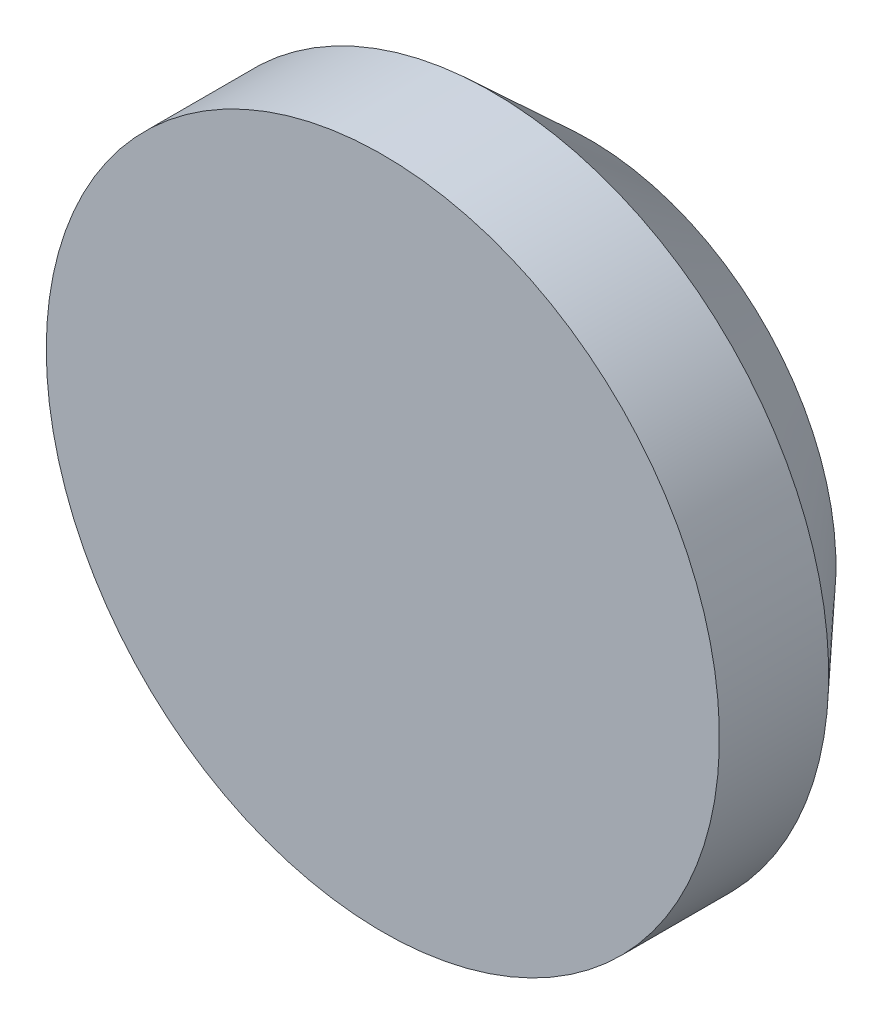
ISO-10303-21;
HEADER;
FILE_DESCRIPTION(('STEP AP214'),'2;1');
FILE_NAME('part.step','',(''),(''),'','','');
FILE_SCHEMA(('AUTOMOTIVE_DESIGN { 1 0 10303 214 1 1 1 1 }'));
ENDSEC;
DATA;
#1=APPLICATION_CONTEXT('core data for automotive mechanical design processes');
#2=APPLICATION_PROTOCOL_DEFINITION('international standard','automotive_design',2000,#1);
#3=PRODUCT_CONTEXT('',#1,'mechanical');
#4=PRODUCT('Part','Part','',(#3));
#5=PRODUCT_RELATED_PRODUCT_CATEGORY('part','',(#4));
#6=PRODUCT_DEFINITION_FORMATION('','',#4);
#7=PRODUCT_DEFINITION_CONTEXT('part definition',#1,'design');
#8=PRODUCT_DEFINITION('design','',#6,#7);
#9=PRODUCT_DEFINITION_SHAPE('','',#8);
#10=(LENGTH_UNIT() NAMED_UNIT(*) SI_UNIT(.MILLI.,.METRE.));
#11=(NAMED_UNIT(*) PLANE_ANGLE_UNIT() SI_UNIT($,.RADIAN.));
#12=(NAMED_UNIT(*) SI_UNIT($,.STERADIAN.) SOLID_ANGLE_UNIT());
#13=UNCERTAINTY_MEASURE_WITH_UNIT(LENGTH_MEASURE(1.E-05),#10,'distance_accuracy_value','');
#14=(GEOMETRIC_REPRESENTATION_CONTEXT(3) GLOBAL_UNCERTAINTY_ASSIGNED_CONTEXT((#13)) GLOBAL_UNIT_ASSIGNED_CONTEXT((#10,
#11,#12)) REPRESENTATION_CONTEXT('',''));
#15=CARTESIAN_POINT('',(0.,0.,0.));
#16=DIRECTION('',(0.,0.,1.));
#17=DIRECTION('',(1.,0.,0.));
#18=AXIS2_PLACEMENT_3D('',#15,#16,#17);
#19=CARTESIAN_POINT('',(650.,0.,-1063.));
#20=DIRECTION('',(0.,0.,-1.));
#21=DIRECTION('',(-1.,0.,0.));
#22=AXIS2_PLACEMENT_3D('',#19,#20,#21);
#23=PLANE('',#22);
#24=CARTESIAN_POINT('',(0.,0.,-1063.));
#25=DIRECTION('',(0.,0.,-1.));
#26=DIRECTION('',(-1.,0.,0.));
#27=AXIS2_PLACEMENT_3D('',#24,#25,#26);
#28=CIRCLE('',#27,650.);
#29=CARTESIAN_POINT('',(-650.,0.,-1063.));
#30=VERTEX_POINT('',#29);
#31=EDGE_CURVE('E23',#30,#30,#28,.T.);
#32=ORIENTED_EDGE('',*,*,#31,.F.);
#33=EDGE_LOOP('',(#32));
#34=FACE_BOUND('',#33,.T.);
#35=ADVANCED_FACE('F13',(#34),#23,.F.);
#36=CARTESIAN_POINT('',(0.,0.,-1463.));
#37=DIRECTION('',(0.,0.,1.));
#38=DIRECTION('',(1.,0.,0.));
#39=AXIS2_PLACEMENT_3D('',#36,#37,#38);
#40=PLANE('',#39);
#41=CARTESIAN_POINT('',(0.,0.,-1463.));
#42=DIRECTION('',(0.,0.,-1.));
#43=DIRECTION('',(-1.,0.,0.));
#44=AXIS2_PLACEMENT_3D('',#41,#42,#43);
#45=CIRCLE('',#44,475.);
#46=CARTESIAN_POINT('',(-475.,0.,-1463.));
#47=VERTEX_POINT('',#46);
#48=EDGE_CURVE('E8',#47,#47,#45,.T.);
#49=ORIENTED_EDGE('',*,*,#48,.T.);
#50=EDGE_LOOP('',(#49));
#51=FACE_BOUND('',#50,.T.);
#52=ADVANCED_FACE('F33',(#51),#40,.F.);
#53=CARTESIAN_POINT('',(0.,0.,-1274.));
#54=DIRECTION('',(0.,0.,1.));
#55=DIRECTION('',(1.,0.,0.));
#56=AXIS2_PLACEMENT_3D('',#53,#54,#55);
#57=CONICAL_SURFACE('',#56,650.,0.746955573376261);
#58=ORIENTED_EDGE('',*,*,#48,.F.);
#59=EDGE_LOOP('',(#58));
#60=FACE_BOUND('',#59,.T.);
#61=CARTESIAN_POINT('',(0.,0.,-1274.));
#62=DIRECTION('',(0.,0.,-1.));
#63=DIRECTION('',(-1.,0.,0.));
#64=AXIS2_PLACEMENT_3D('',#61,#62,#63);
#65=CIRCLE('',#64,650.);
#66=CARTESIAN_POINT('',(-650.,0.,-1274.));
#67=VERTEX_POINT('',#66);
#68=EDGE_CURVE('E19',#67,#67,#65,.T.);
#69=ORIENTED_EDGE('',*,*,#68,.T.);
#70=EDGE_LOOP('',(#69));
#71=FACE_BOUND('',#70,.T.);
#72=ADVANCED_FACE('F39',(#60,#71),#57,.T.);
#73=CARTESIAN_POINT('',(0.,0.,0.));
#74=DIRECTION('',(0.,0.,-1.));
#75=DIRECTION('',(-1.,0.,0.));
#76=AXIS2_PLACEMENT_3D('',#73,#74,#75);
#77=CYLINDRICAL_SURFACE('',#76,650.);
#78=ORIENTED_EDGE('',*,*,#68,.F.);
#79=EDGE_LOOP('',(#78));
#80=FACE_BOUND('',#79,.T.);
#81=ORIENTED_EDGE('',*,*,#31,.T.);
#82=EDGE_LOOP('',(#81));
#83=FACE_BOUND('',#82,.T.);
#84=ADVANCED_FACE('F30',(#80,#83),#77,.T.);
#85=CLOSED_SHELL('',(#35,#52,#72,#84));
#86=MANIFOLD_SOLID_BREP('B1',#85);
#87=ADVANCED_BREP_SHAPE_REPRESENTATION('',(#18,#86),#14);
#88=SHAPE_DEFINITION_REPRESENTATION(#9,#87);
ENDSEC;
END-ISO-10303-21;
